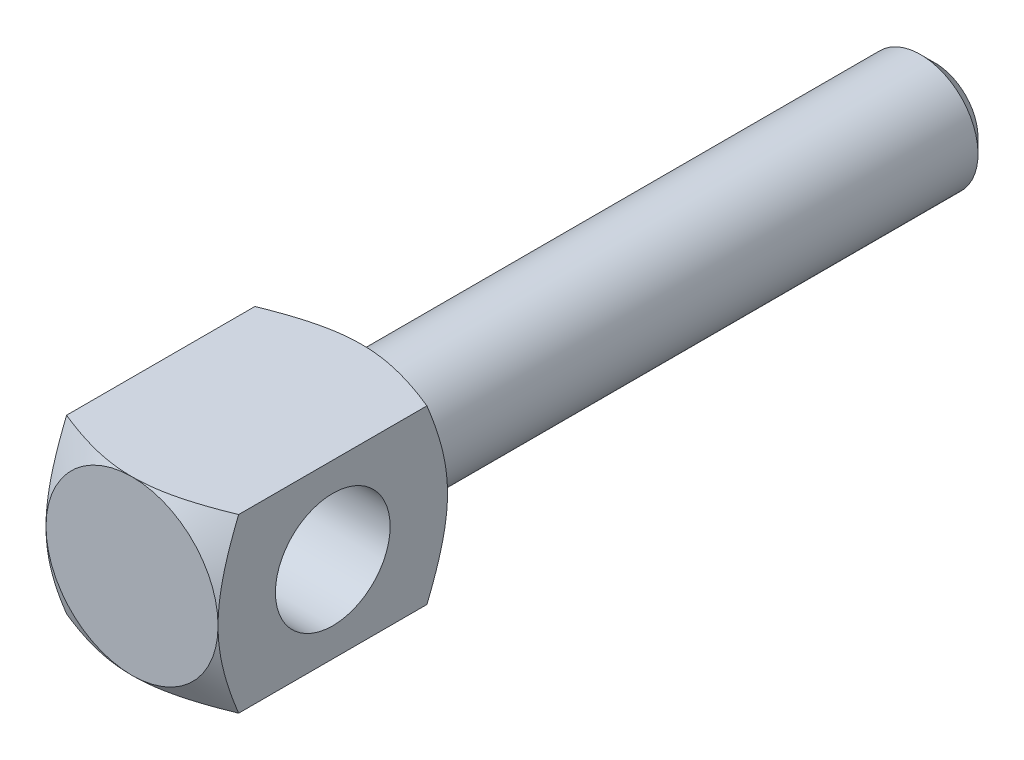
ISO-10303-21;
HEADER;
FILE_DESCRIPTION(('STEP AP214'),'2;1');
FILE_NAME('part.step','',(''),(''),'','','');
FILE_SCHEMA(('AUTOMOTIVE_DESIGN { 1 0 10303 214 1 1 1 1 }'));
ENDSEC;
DATA;
#1=APPLICATION_CONTEXT('core data for automotive mechanical design processes');
#2=APPLICATION_PROTOCOL_DEFINITION('international standard','automotive_design',2000,#1);
#3=PRODUCT_CONTEXT('',#1,'mechanical');
#4=PRODUCT('Part','Part','',(#3));
#5=PRODUCT_RELATED_PRODUCT_CATEGORY('part','',(#4));
#6=PRODUCT_DEFINITION_FORMATION('','',#4);
#7=PRODUCT_DEFINITION_CONTEXT('part definition',#1,'design');
#8=PRODUCT_DEFINITION('design','',#6,#7);
#9=PRODUCT_DEFINITION_SHAPE('','',#8);
#10=(LENGTH_UNIT() NAMED_UNIT(*) SI_UNIT(.MILLI.,.METRE.));
#11=(NAMED_UNIT(*) PLANE_ANGLE_UNIT() SI_UNIT($,.RADIAN.));
#12=(NAMED_UNIT(*) SI_UNIT($,.STERADIAN.) SOLID_ANGLE_UNIT());
#13=UNCERTAINTY_MEASURE_WITH_UNIT(LENGTH_MEASURE(1.E-05),#10,'distance_accuracy_value','');
#14=(GEOMETRIC_REPRESENTATION_CONTEXT(3) GLOBAL_UNCERTAINTY_ASSIGNED_CONTEXT((#13)) GLOBAL_UNIT_ASSIGNED_CONTEXT((#10,
#11,#12)) REPRESENTATION_CONTEXT('',''));
#15=CARTESIAN_POINT('',(0.,0.,0.));
#16=DIRECTION('',(0.,0.,1.));
#17=DIRECTION('',(1.,0.,0.));
#18=AXIS2_PLACEMENT_3D('',#15,#16,#17);
#19=CARTESIAN_POINT('',(0.,-8.,80.));
#20=DIRECTION('',(0.,0.,1.));
#21=DIRECTION('',(0.,-1.,0.));
#22=AXIS2_PLACEMENT_3D('',#19,#20,#21);
#23=PLANE('',#22);
#24=CARTESIAN_POINT('',(0.,0.,80.));
#25=DIRECTION('',(0.,0.,1.));
#26=DIRECTION('',(0.,-1.,0.));
#27=AXIS2_PLACEMENT_3D('',#24,#25,#26);
#28=CIRCLE('',#27,8.);
#29=CARTESIAN_POINT('',(0.,-8.,80.));
#30=VERTEX_POINT('',#29);
#31=EDGE_CURVE('E193',#30,#30,#28,.T.);
#32=ORIENTED_EDGE('',*,*,#31,.T.);
#33=EDGE_LOOP('',(#32));
#34=FACE_BOUND('',#33,.T.);
#35=CARTESIAN_POINT('',(0.,0.,80.));
#36=DIRECTION('',(0.,0.,1.));
#37=DIRECTION('',(0.,-1.,0.));
#38=AXIS2_PLACEMENT_3D('',#35,#36,#37);
#39=CIRCLE('',#38,12.);
#40=CARTESIAN_POINT('',(0.,-12.,80.));
#41=VERTEX_POINT('',#40);
#42=CARTESIAN_POINT('',(12.,0.,80.));
#43=VERTEX_POINT('',#42);
#44=EDGE_CURVE('E82',#41,#43,#39,.T.);
#45=ORIENTED_EDGE('',*,*,#44,.F.);
#46=CARTESIAN_POINT('',(0.,0.,80.));
#47=DIRECTION('',(0.,0.,1.));
#48=DIRECTION('',(0.,-1.,0.));
#49=AXIS2_PLACEMENT_3D('',#46,#47,#48);
#50=CIRCLE('',#49,12.);
#51=CARTESIAN_POINT('',(-12.,0.,80.));
#52=VERTEX_POINT('',#51);
#53=EDGE_CURVE('E18',#52,#41,#50,.T.);
#54=ORIENTED_EDGE('',*,*,#53,.F.);
#55=CARTESIAN_POINT('',(0.,12.,80.));
#56=VERTEX_POINT('',#55);
#57=EDGE_CURVE('E23',#56,#52,#50,.T.);
#58=ORIENTED_EDGE('',*,*,#57,.F.);
#59=EDGE_CURVE('E9',#43,#56,#50,.T.);
#60=ORIENTED_EDGE('',*,*,#59,.F.);
#61=EDGE_LOOP('',(#45,#54,#58,#60));
#62=FACE_BOUND('',#61,.T.);
#63=ADVANCED_FACE('F14',(#34,#62),#23,.F.);
#64=CARTESIAN_POINT('',(0.,0.,0.));
#65=DIRECTION('',(0.,0.,1.));
#66=DIRECTION('',(0.,-1.,0.));
#67=AXIS2_PLACEMENT_3D('',#64,#65,#66);
#68=PLANE('',#67);
#69=CARTESIAN_POINT('',(0.,0.,0.));
#70=DIRECTION('',(0.,0.,1.));
#71=DIRECTION('',(0.,-1.,0.));
#72=AXIS2_PLACEMENT_3D('',#69,#70,#71);
#73=CIRCLE('',#72,6.);
#74=CARTESIAN_POINT('',(0.,-6.,0.));
#75=VERTEX_POINT('',#74);
#76=EDGE_CURVE('E199',#75,#75,#73,.T.);
#77=ORIENTED_EDGE('',*,*,#76,.F.);
#78=EDGE_LOOP('',(#77));
#79=FACE_BOUND('',#78,.T.);
#80=ADVANCED_FACE('F16',(#79),#68,.F.);
#81=CARTESIAN_POINT('',(0.,0.,2.));
#82=DIRECTION('',(0.,0.,1.));
#83=DIRECTION('',(0.,-1.,0.));
#84=AXIS2_PLACEMENT_3D('',#81,#82,#83);
#85=CONICAL_SURFACE('',#84,8.,0.785398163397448);
#86=ORIENTED_EDGE('',*,*,#76,.T.);
#87=EDGE_LOOP('',(#86));
#88=FACE_BOUND('',#87,.T.);
#89=CARTESIAN_POINT('',(0.,0.,2.));
#90=DIRECTION('',(0.,0.,1.));
#91=DIRECTION('',(0.,-1.,0.));
#92=AXIS2_PLACEMENT_3D('',#89,#90,#91);
#93=CIRCLE('',#92,8.);
#94=CARTESIAN_POINT('',(0.,-8.,2.));
#95=VERTEX_POINT('',#94);
#96=EDGE_CURVE('E196',#95,#95,#93,.T.);
#97=ORIENTED_EDGE('',*,*,#96,.F.);
#98=EDGE_LOOP('',(#97));
#99=FACE_BOUND('',#98,.T.);
#100=ADVANCED_FACE('F251',(#88,#99),#85,.T.);
#101=CARTESIAN_POINT('',(0.,0.,140.));
#102=DIRECTION('',(0.,0.,1.));
#103=DIRECTION('',(0.,-1.,0.));
#104=AXIS2_PLACEMENT_3D('',#101,#102,#103);
#105=CYLINDRICAL_SURFACE('',#104,8.);
#106=ORIENTED_EDGE('',*,*,#31,.F.);
#107=EDGE_LOOP('',(#106));
#108=FACE_BOUND('',#107,.T.);
#109=ORIENTED_EDGE('',*,*,#96,.T.);
#110=EDGE_LOOP('',(#109));
#111=FACE_BOUND('',#110,.T.);
#112=ADVANCED_FACE('F254',(#108,#111),#105,.T.);
#113=CARTESIAN_POINT('',(0.,0.,86.0291163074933));
#114=DIRECTION('',(0.,0.,1.));
#115=DIRECTION('',(0.,-1.,0.));
#116=AXIS2_PLACEMENT_3D('',#113,#114,#115);
#117=CONICAL_SURFACE('',#116,22.4427357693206,1.0471975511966);
#118=CARTESIAN_POINT('',(-24.2982294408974,-12.,88.7179246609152));
#119=CARTESIAN_POINT('',(-23.7086454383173,-12.,88.4127647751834));
#120=CARTESIAN_POINT('',(-23.1182016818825,-12.,88.1092505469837));
#121=CARTESIAN_POINT('',(-21.9351490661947,-12.,87.5063885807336));
#122=CARTESIAN_POINT('',(-21.3425400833,-12.,87.2070410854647));
#123=CARTESIAN_POINT('',(-20.1534978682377,-12.,86.6127827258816));
#124=CARTESIAN_POINT('',(-19.5570591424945,-12.,86.3178828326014));
#125=CARTESIAN_POINT('',(-18.3610928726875,-12.,85.7344367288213));
#126=CARTESIAN_POINT('',(-17.7615653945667,-12.,85.4458903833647));
#127=CARTESIAN_POINT('',(-16.5244595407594,-12.,84.8605610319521));
#128=CARTESIAN_POINT('',(-15.8866592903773,-12.,84.5642453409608));
#129=CARTESIAN_POINT('',(-14.605771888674,-12.,83.9831303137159));
#130=CARTESIAN_POINT('',(-13.9626844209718,-12.,83.6983316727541));
#131=CARTESIAN_POINT('',(-12.6704771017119,-12.,83.1440967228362));
#132=CARTESIAN_POINT('',(-12.0213625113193,-12.,82.8746482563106));
#133=CARTESIAN_POINT('',(-11.0416965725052,-12.,82.4856727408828));
#134=CARTESIAN_POINT('',(-10.7141576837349,-12.,82.3585526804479));
#135=CARTESIAN_POINT('',(-10.0568574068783,-12.,82.1102063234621));
#136=CARTESIAN_POINT('',(-9.72709608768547,-12.,81.9889798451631));
#137=CARTESIAN_POINT('',(-9.06895687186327,-12.,81.7547235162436));
#138=CARTESIAN_POINT('',(-8.74060700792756,-12.,81.641615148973));
#139=CARTESIAN_POINT('',(-8.08133457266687,-12.,81.4231457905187));
#140=CARTESIAN_POINT('',(-7.75041201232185,-12.,81.3177847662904));
#141=CARTESIAN_POINT('',(-7.0857909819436,-12.,81.1160197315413));
#142=CARTESIAN_POINT('',(-6.75209224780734,-12.,81.0196165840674));
#143=CARTESIAN_POINT('',(-6.08190101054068,-12.,80.8371495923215));
#144=CARTESIAN_POINT('',(-5.74540850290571,-12.,80.7510857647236));
#145=CARTESIAN_POINT('',(-4.74513490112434,-12.,80.5138469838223));
#146=CARTESIAN_POINT('',(-4.07715641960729,-12.,80.3794466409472));
#147=CARTESIAN_POINT('',(-3.06859856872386,-12.,80.2204909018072));
#148=CARTESIAN_POINT('',(-2.73130381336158,-12.,80.1746123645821));
#149=CARTESIAN_POINT('',(-2.05498982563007,-12.,80.0982487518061));
#150=CARTESIAN_POINT('',(-1.71597079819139,-12.,80.0677618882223));
#151=CARTESIAN_POINT('',(-0.957299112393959,-12.,80.0178569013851));
#152=CARTESIAN_POINT('',(-0.537356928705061,-12.,80.0027032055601));
#153=CARTESIAN_POINT('',(0.302681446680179,-12.,79.9979591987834));
#154=CARTESIAN_POINT('',(0.722777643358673,-12.,80.0083698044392));
#155=CARTESIAN_POINT('',(1.5616630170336,-12.,80.0542594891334));
#156=CARTESIAN_POINT('',(1.98045192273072,-12.,80.0897434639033));
#157=CARTESIAN_POINT('',(2.81535093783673,-12.,80.184192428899));
#158=CARTESIAN_POINT('',(3.23146095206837,-12.,80.2431582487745));
#159=CARTESIAN_POINT('',(4.07191225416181,-12.,80.3842092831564));
#160=CARTESIAN_POINT('',(4.49614983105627,-12.,80.4669059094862));
#161=CARTESIAN_POINT('',(5.34033241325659,-12.,80.6517378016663));
#162=CARTESIAN_POINT('',(5.76027730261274,-12.,80.7538735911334));
#163=CARTESIAN_POINT('',(6.59600415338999,-12.,80.974730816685));
#164=CARTESIAN_POINT('',(7.01178366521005,-12.,81.0934614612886));
#165=CARTESIAN_POINT('',(7.63224330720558,-12.,81.2819580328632));
#166=CARTESIAN_POINT('',(7.83852562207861,-12.,81.3465227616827));
#167=CARTESIAN_POINT('',(8.25007065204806,-12.,81.4788265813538));
#168=CARTESIAN_POINT('',(8.45533336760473,-12.,81.5465656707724));
#169=CARTESIAN_POINT('',(9.02725013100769,-12.,81.7397944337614));
#170=CARTESIAN_POINT('',(9.39282355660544,-12.,81.8684872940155));
#171=CARTESIAN_POINT('',(10.1211104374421,-12.,82.1337513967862));
#172=CARTESIAN_POINT('',(10.4838237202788,-12.,82.270323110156));
#173=CARTESIAN_POINT('',(11.2067348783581,-12.,82.5501753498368));
#174=CARTESIAN_POINT('',(11.5669322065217,-12.,82.6934572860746));
#175=CARTESIAN_POINT('',(12.2850180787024,-12.,82.9857066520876));
#176=CARTESIAN_POINT('',(12.642906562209,-12.,83.1346742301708));
#177=CARTESIAN_POINT('',(13.3569451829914,-12.,83.4375943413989));
#178=CARTESIAN_POINT('',(13.7130934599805,-12.,83.5915512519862));
#179=CARTESIAN_POINT('',(14.4235611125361,-12.,83.9036334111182));
#180=CARTESIAN_POINT('',(14.7778804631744,-12.,84.0617587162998));
#181=CARTESIAN_POINT('',(15.838324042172,-12.,84.5414516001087));
#182=CARTESIAN_POINT('',(16.5420262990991,-12.,84.8683757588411));
#183=CARTESIAN_POINT('',(17.9465349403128,-12.,85.5339677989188));
#184=CARTESIAN_POINT('',(18.6473252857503,-12.,85.87266934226));
#185=CARTESIAN_POINT('',(20.0448594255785,-12.,86.5583429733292));
#186=CARTESIAN_POINT('',(20.7416031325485,-12.,86.9053152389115));
#187=CARTESIAN_POINT('',(22.1314681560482,-12.,87.6055143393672));
#188=CARTESIAN_POINT('',(22.82459120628,-12.,87.9587377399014));
#189=CARTESIAN_POINT('',(24.2082049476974,-12.,88.6702835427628));
#190=CARTESIAN_POINT('',(24.8986956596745,-12.,89.0286059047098));
#191=CARTESIAN_POINT('',(26.1844303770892,-12.,89.7006909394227));
#192=CARTESIAN_POINT('',(26.779944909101,-12.,90.0139366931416));
#193=CARTESIAN_POINT('',(27.9696112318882,-12.,90.643006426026));
#194=CARTESIAN_POINT('',(28.5637630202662,-12.,90.9588304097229));
#195=CARTESIAN_POINT('',(30.3446602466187,-12.,91.9096432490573));
#196=CARTESIAN_POINT('',(31.529671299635,-12.,92.5478805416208));
#197=CARTESIAN_POINT('',(33.8885309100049,-12.,93.8264689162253));
#198=CARTESIAN_POINT('',(35.0624017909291,-12.,94.4667788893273));
#199=CARTESIAN_POINT('',(36.8211677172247,-12.,95.4307219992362));
#200=CARTESIAN_POINT('',(37.40703228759,-12.,95.7525880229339));
#201=CARTESIAN_POINT('',(38.5781881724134,-12.,96.3973591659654));
#202=CARTESIAN_POINT('',(39.1634794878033,-12.,96.7202642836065));
#203=CARTESIAN_POINT('',(39.7485215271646,-12.,97.0436202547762));
#204=B_SPLINE_CURVE_WITH_KNOTS('',3,(#118,#119,#120,#121,#122,#123,#124,#125,#126,#127,#128,
#129,#130,#131,#132,#133,#134,#135,#136,#137,#138,#139,#140,#141,#142,#143,#144,#145,#146,#147,
#148,#149,#150,#151,#152,#153,#154,#155,#156,#157,#158,#159,#160,#161,#162,#163,#164,#165,#166,
#167,#168,#169,#170,#171,#172,#173,#174,#175,#176,#177,#178,#179,#180,#181,#182,#183,#184,#185,
#186,#187,#188,#189,#190,#191,#192,#193,#194,#195,#196,#197,#198,#199,#200,#201,#202,#203),
.UNSPECIFIED.,.F.,.F.,(4,2,2,2,2,2,2,2,2,2,2,2,2,2,2,2,2,2,2,2,2,2,2,2,2,2,2,2,2,2,2,2,2,2,2,2,
2,2,2,2,2,2,4),(0.,1.99163711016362,3.98338978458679,5.97944161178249,7.97545099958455,
10.0851776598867,12.1950314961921,14.3031903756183,15.3571713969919,16.4111198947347,
17.4528918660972,18.4946593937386,19.536527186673,20.5783966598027,22.6200951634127,
23.6410070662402,24.6618003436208,25.9216607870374,27.1815664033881,28.4417180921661,
29.7019143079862,30.9980518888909,32.2942243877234,33.5911190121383,34.2395496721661,
34.8879800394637,36.0505552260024,37.2131999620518,38.3760900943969,39.5390105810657,
40.7029805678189,41.8669663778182,44.1946361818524,46.5296172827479,48.8646486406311,
51.1984346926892,53.5322022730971,55.5508194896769,57.5694402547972,61.6072788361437,
65.6187152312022,67.6240859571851,69.6294534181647),.UNSPECIFIED.);
#205=CARTESIAN_POINT('',(-12.,-12.,82.8697557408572));
#206=VERTEX_POINT('',#205);
#207=EDGE_CURVE('E89',#41,#206,#204,.F.);
#208=ORIENTED_EDGE('',*,*,#207,.T.);
#209=CARTESIAN_POINT('',(-12.,24.2982294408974,88.7179246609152));
#210=CARTESIAN_POINT('',(-12.,23.7086454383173,88.4127647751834));
#211=CARTESIAN_POINT('',(-12.,23.1182016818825,88.1092505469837));
#212=CARTESIAN_POINT('',(-12.,21.9351490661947,87.5063885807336));
#213=CARTESIAN_POINT('',(-12.,21.3425400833,87.2070410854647));
#214=CARTESIAN_POINT('',(-12.,20.1534978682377,86.6127827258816));
#215=CARTESIAN_POINT('',(-12.,19.5570591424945,86.3178828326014));
#216=CARTESIAN_POINT('',(-12.,18.3610928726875,85.7344367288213));
#217=CARTESIAN_POINT('',(-12.,17.7615653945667,85.4458903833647));
#218=CARTESIAN_POINT('',(-12.,16.5244595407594,84.8605610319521));
#219=CARTESIAN_POINT('',(-12.,15.8866592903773,84.5642453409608));
#220=CARTESIAN_POINT('',(-12.,14.605771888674,83.9831303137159));
#221=CARTESIAN_POINT('',(-12.,13.9626844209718,83.6983316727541));
#222=CARTESIAN_POINT('',(-12.,12.6704771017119,83.1440967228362));
#223=CARTESIAN_POINT('',(-12.,12.0213625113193,82.8746482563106));
#224=CARTESIAN_POINT('',(-12.,11.0416965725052,82.4856727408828));
#225=CARTESIAN_POINT('',(-12.,10.7141576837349,82.3585526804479));
#226=CARTESIAN_POINT('',(-12.,10.0568574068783,82.1102063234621));
#227=CARTESIAN_POINT('',(-12.,9.72709608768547,81.9889798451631));
#228=CARTESIAN_POINT('',(-12.,9.06895687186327,81.7547235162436));
#229=CARTESIAN_POINT('',(-12.,8.74060700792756,81.641615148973));
#230=CARTESIAN_POINT('',(-12.,8.08133457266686,81.4231457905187));
#231=CARTESIAN_POINT('',(-12.,7.75041201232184,81.3177847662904));
#232=CARTESIAN_POINT('',(-12.,7.0857909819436,81.1160197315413));
#233=CARTESIAN_POINT('',(-12.,6.75209224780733,81.0196165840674));
#234=CARTESIAN_POINT('',(-12.,6.08190101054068,80.8371495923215));
#235=CARTESIAN_POINT('',(-12.,5.7454085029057,80.7510857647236));
#236=CARTESIAN_POINT('',(-12.,4.74513490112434,80.5138469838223));
#237=CARTESIAN_POINT('',(-12.,4.07715641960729,80.3794466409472));
#238=CARTESIAN_POINT('',(-12.,3.06859856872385,80.2204909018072));
#239=CARTESIAN_POINT('',(-12.,2.73130381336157,80.1746123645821));
#240=CARTESIAN_POINT('',(-12.,2.05498982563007,80.0982487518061));
#241=CARTESIAN_POINT('',(-12.,1.71597079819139,80.0677618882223));
#242=CARTESIAN_POINT('',(-12.,0.95729911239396,80.0178569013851));
#243=CARTESIAN_POINT('',(-12.,0.537356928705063,80.0027032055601));
#244=CARTESIAN_POINT('',(-12.,-0.302681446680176,79.9979591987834));
#245=CARTESIAN_POINT('',(-12.,-0.72277764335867,80.0083698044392));
#246=CARTESIAN_POINT('',(-12.,-1.56166301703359,80.0542594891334));
#247=CARTESIAN_POINT('',(-12.,-1.98045192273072,80.0897434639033));
#248=CARTESIAN_POINT('',(-12.,-2.81535093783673,80.184192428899));
#249=CARTESIAN_POINT('',(-12.,-3.23146095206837,80.2431582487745));
#250=CARTESIAN_POINT('',(-12.,-4.07191225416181,80.3842092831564));
#251=CARTESIAN_POINT('',(-12.,-4.49614983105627,80.4669059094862));
#252=CARTESIAN_POINT('',(-12.,-5.34033241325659,80.6517378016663));
#253=CARTESIAN_POINT('',(-12.,-5.76027730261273,80.7538735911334));
#254=CARTESIAN_POINT('',(-12.,-6.59600415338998,80.974730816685));
#255=CARTESIAN_POINT('',(-12.,-7.01178366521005,81.0934614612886));
#256=CARTESIAN_POINT('',(-12.,-7.63224330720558,81.2819580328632));
#257=CARTESIAN_POINT('',(-12.,-7.83852562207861,81.3465227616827));
#258=CARTESIAN_POINT('',(-12.,-8.25007065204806,81.4788265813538));
#259=CARTESIAN_POINT('',(-12.,-8.45533336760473,81.5465656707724));
#260=CARTESIAN_POINT('',(-12.,-9.02725013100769,81.7397944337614));
#261=CARTESIAN_POINT('',(-12.,-9.39282355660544,81.8684872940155));
#262=CARTESIAN_POINT('',(-12.,-10.1211104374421,82.1337513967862));
#263=CARTESIAN_POINT('',(-12.,-10.4838237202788,82.270323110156));
#264=CARTESIAN_POINT('',(-12.,-11.2067348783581,82.5501753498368));
#265=CARTESIAN_POINT('',(-12.,-11.5669322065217,82.6934572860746));
#266=CARTESIAN_POINT('',(-12.,-12.2850180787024,82.9857066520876));
#267=CARTESIAN_POINT('',(-12.,-12.642906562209,83.1346742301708));
#268=CARTESIAN_POINT('',(-12.,-13.3569451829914,83.4375943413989));
#269=CARTESIAN_POINT('',(-12.,-13.7130934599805,83.5915512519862));
#270=CARTESIAN_POINT('',(-12.,-14.4235611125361,83.9036334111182));
#271=CARTESIAN_POINT('',(-12.,-14.7778804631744,84.0617587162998));
#272=CARTESIAN_POINT('',(-12.,-15.838324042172,84.5414516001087));
#273=CARTESIAN_POINT('',(-12.,-16.5420262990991,84.8683757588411));
#274=CARTESIAN_POINT('',(-12.,-17.9465349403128,85.5339677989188));
#275=CARTESIAN_POINT('',(-12.,-18.6473252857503,85.87266934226));
#276=CARTESIAN_POINT('',(-12.,-20.0448594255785,86.5583429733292));
#277=CARTESIAN_POINT('',(-12.,-20.7416031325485,86.9053152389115));
#278=CARTESIAN_POINT('',(-12.,-22.1314681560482,87.6055143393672));
#279=CARTESIAN_POINT('',(-12.,-22.82459120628,87.9587377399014));
#280=CARTESIAN_POINT('',(-12.,-24.2082049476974,88.6702835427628));
#281=CARTESIAN_POINT('',(-12.,-24.8986956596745,89.0286059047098));
#282=CARTESIAN_POINT('',(-12.,-26.1844303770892,89.7006909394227));
#283=CARTESIAN_POINT('',(-12.,-26.779944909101,90.0139366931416));
#284=CARTESIAN_POINT('',(-12.,-27.9696112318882,90.643006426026));
#285=CARTESIAN_POINT('',(-12.,-28.5637630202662,90.9588304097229));
#286=CARTESIAN_POINT('',(-12.,-30.3446602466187,91.9096432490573));
#287=CARTESIAN_POINT('',(-12.,-31.529671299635,92.5478805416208));
#288=CARTESIAN_POINT('',(-12.,-33.8885309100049,93.8264689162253));
#289=CARTESIAN_POINT('',(-12.,-35.0624017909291,94.4667788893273));
#290=CARTESIAN_POINT('',(-12.,-36.8211677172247,95.4307219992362));
#291=CARTESIAN_POINT('',(-12.,-37.40703228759,95.7525880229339));
#292=CARTESIAN_POINT('',(-12.,-38.5781881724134,96.3973591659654));
#293=CARTESIAN_POINT('',(-12.,-39.1634794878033,96.7202642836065));
#294=CARTESIAN_POINT('',(-12.,-39.7485215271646,97.0436202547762));
#295=B_SPLINE_CURVE_WITH_KNOTS('',3,(#209,#210,#211,#212,#213,#214,#215,#216,#217,#218,#219,
#220,#221,#222,#223,#224,#225,#226,#227,#228,#229,#230,#231,#232,#233,#234,#235,#236,#237,#238,
#239,#240,#241,#242,#243,#244,#245,#246,#247,#248,#249,#250,#251,#252,#253,#254,#255,#256,#257,
#258,#259,#260,#261,#262,#263,#264,#265,#266,#267,#268,#269,#270,#271,#272,#273,#274,#275,#276,
#277,#278,#279,#280,#281,#282,#283,#284,#285,#286,#287,#288,#289,#290,#291,#292,#293,#294),
.UNSPECIFIED.,.F.,.F.,(4,2,2,2,2,2,2,2,2,2,2,2,2,2,2,2,2,2,2,2,2,2,2,2,2,2,2,2,2,2,2,2,2,2,2,2,
2,2,2,2,2,2,4),(0.,1.99163711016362,3.98338978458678,5.97944161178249,7.97545099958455,
10.0851776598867,12.1950314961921,14.3031903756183,15.3571713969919,16.4111198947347,
17.4528918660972,18.4946593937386,19.536527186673,20.5783966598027,22.6200951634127,
23.6410070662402,24.6618003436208,25.9216607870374,27.1815664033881,28.4417180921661,
29.7019143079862,30.9980518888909,32.2942243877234,33.5911190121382,34.2395496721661,
34.8879800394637,36.0505552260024,37.2131999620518,38.3760900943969,39.5390105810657,
40.7029805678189,41.8669663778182,44.1946361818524,46.5296172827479,48.8646486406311,
51.1984346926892,53.5322022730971,55.5508194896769,57.5694402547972,61.6072788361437,
65.6187152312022,67.6240859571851,69.6294534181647),.UNSPECIFIED.);
#296=EDGE_CURVE('E96',#52,#206,#295,.T.);
#297=ORIENTED_EDGE('',*,*,#296,.F.);
#298=ORIENTED_EDGE('',*,*,#53,.T.);
#299=EDGE_LOOP('',(#208,#297,#298));
#300=FACE_BOUND('',#299,.T.);
#301=ADVANCED_FACE('F94',(#300),#117,.T.);
#302=ORIENTED_EDGE('',*,*,#57,.T.);
#303=CARTESIAN_POINT('',(-12.,12.,82.8697557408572));
#304=VERTEX_POINT('',#303);
#305=EDGE_CURVE('E106',#304,#52,#295,.T.);
#306=ORIENTED_EDGE('',*,*,#305,.F.);
#307=CARTESIAN_POINT('',(-24.2982294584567,12.,88.7179246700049));
#308=CARTESIAN_POINT('',(-23.7086454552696,12.,88.4127647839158));
#309=CARTESIAN_POINT('',(-23.1182016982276,12.,88.1092505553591));
#310=CARTESIAN_POINT('',(-21.9351490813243,12.,87.5063885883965));
#311=CARTESIAN_POINT('',(-21.3425400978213,12.,87.2070410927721));
#312=CARTESIAN_POINT('',(-20.1534978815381,12.,86.612782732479));
#313=CARTESIAN_POINT('',(-19.5570591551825,12.,86.3178828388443));
#314=CARTESIAN_POINT('',(-18.361092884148,12.,85.7344367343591));
#315=CARTESIAN_POINT('',(-17.7615654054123,12.,85.445890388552));
#316=CARTESIAN_POINT('',(-16.5244595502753,12.,84.8605610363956));
#317=CARTESIAN_POINT('',(-15.8866592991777,12.,84.5642453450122));
#318=CARTESIAN_POINT('',(-14.6057718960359,12.,83.9831303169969));
#319=CARTESIAN_POINT('',(-13.9626844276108,12.,83.6983316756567));
#320=CARTESIAN_POINT('',(-12.6704771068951,12.,83.1440967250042));
#321=CARTESIAN_POINT('',(-12.0213625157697,12.,82.8746482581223));
#322=CARTESIAN_POINT('',(-11.0416965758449,12.,82.4856727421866));
#323=CARTESIAN_POINT('',(-10.7141576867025,12.,82.3585526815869));
#324=CARTESIAN_POINT('',(-10.056857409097,12.,82.1102063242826));
#325=CARTESIAN_POINT('',(-9.72709608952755,12.,81.9889798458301));
#326=CARTESIAN_POINT('',(-9.06895687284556,12.,81.7547235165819));
#327=CARTESIAN_POINT('',(-8.74060700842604,12.,81.6416151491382));
#328=CARTESIAN_POINT('',(-8.08133457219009,12.,81.4231457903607));
#329=CARTESIAN_POINT('',(-7.75041201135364,12.,81.3177847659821));
#330=CARTESIAN_POINT('',(-7.08579097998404,12.,81.1160197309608));
#331=CARTESIAN_POINT('',(-6.75209224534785,12.,81.019616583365));
#332=CARTESIAN_POINT('',(-6.08190100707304,12.,80.8371495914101));
#333=CARTESIAN_POINT('',(-5.74540849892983,12.,80.7510857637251));
#334=CARTESIAN_POINT('',(-4.74513489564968,12.,80.5138469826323));
#335=CARTESIAN_POINT('',(-4.07715641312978,12.,80.3794466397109));
#336=CARTESIAN_POINT('',(-3.06859856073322,12.,80.2204909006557));
#337=CARTESIAN_POINT('',(-2.73130380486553,12.,80.1746123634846));
#338=CARTESIAN_POINT('',(-2.05498981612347,12.,80.0982487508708));
#339=CARTESIAN_POINT('',(-1.71597078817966,12.,80.0677618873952));
#340=CARTESIAN_POINT('',(-0.957299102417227,12.,80.0178569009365));
#341=CARTESIAN_POINT('',(-0.537356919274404,12.,80.0027032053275));
#342=CARTESIAN_POINT('',(0.302681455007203,12.,79.9979591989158));
#343=CARTESIAN_POINT('',(0.722777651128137,12.,80.0083698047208));
#344=CARTESIAN_POINT('',(1.56166302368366,12.,80.0542594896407));
#345=CARTESIAN_POINT('',(1.98045192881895,12.,80.0897434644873));
#346=CARTESIAN_POINT('',(2.81535094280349,12.,80.1841924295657));
#347=CARTESIAN_POINT('',(3.23146095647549,12.,80.2431582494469));
#348=CARTESIAN_POINT('',(4.07191225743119,12.,80.3842092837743));
#349=CARTESIAN_POINT('',(4.49614983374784,12.,80.4669059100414));
#350=CARTESIAN_POINT('',(5.34033241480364,12.,80.6517378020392));
#351=CARTESIAN_POINT('',(5.76027730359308,12.,80.7538735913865));
#352=CARTESIAN_POINT('',(6.59600415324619,12.,80.9747308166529));
#353=CARTESIAN_POINT('',(7.01178366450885,12.,81.0934614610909));
#354=CARTESIAN_POINT('',(7.63224330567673,12.,81.2819580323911));
#355=CARTESIAN_POINT('',(7.83852562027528,12.,81.3465227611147));
#356=CARTESIAN_POINT('',(8.25007064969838,12.,81.4788265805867));
#357=CARTESIAN_POINT('',(8.45533336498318,12.,81.5465656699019));
#358=CARTESIAN_POINT('',(9.02725012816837,12.,81.7397944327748));
#359=CARTESIAN_POINT('',(9.39282355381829,12.,81.8684872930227));
#360=CARTESIAN_POINT('',(10.1211104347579,12.,82.1337513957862));
#361=CARTESIAN_POINT('',(10.4838237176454,12.,82.270323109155));
#362=CARTESIAN_POINT('',(11.2067348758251,12.,82.5501753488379));
#363=CARTESIAN_POINT('',(11.5669322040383,12.,82.6934572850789));
#364=CARTESIAN_POINT('',(12.285018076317,12.,82.9857066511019));
#365=CARTESIAN_POINT('',(12.6429065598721,12.,83.1346742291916));
#366=CARTESIAN_POINT('',(13.3569451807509,12.,83.4375943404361));
#367=CARTESIAN_POINT('',(13.7130934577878,12.,83.591551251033));
#368=CARTESIAN_POINT('',(14.4235611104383,12.,83.9036334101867));
#369=CARTESIAN_POINT('',(14.7778804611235,12.,84.0617587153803));
#370=CARTESIAN_POINT('',(15.8383240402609,12.,84.5414515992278));
#371=CARTESIAN_POINT('',(16.5420262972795,12.,84.8683757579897));
#372=CARTESIAN_POINT('',(17.9465349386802,12.,85.5339677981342));
#373=CARTESIAN_POINT('',(18.6473252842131,12.,85.8726693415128));
#374=CARTESIAN_POINT('',(20.0448594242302,12.,86.5583429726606));
#375=CARTESIAN_POINT('',(20.7416031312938,12.,86.905315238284));
#376=CARTESIAN_POINT('',(22.131468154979,12.,87.6055143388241));
#377=CARTESIAN_POINT('',(22.8245912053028,12.,87.9587377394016));
#378=CARTESIAN_POINT('',(24.2082049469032,12.,88.6702835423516));
#379=CARTESIAN_POINT('',(24.8986956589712,12.,89.0286059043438));
#380=CARTESIAN_POINT('',(26.1844303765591,12.,89.7006909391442));
#381=CARTESIAN_POINT('',(26.7799449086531,12.,90.0139366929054));
#382=CARTESIAN_POINT('',(27.9696112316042,12.,90.6430064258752));
#383=CARTESIAN_POINT('',(28.563763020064,12.,90.9588304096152));
#384=CARTESIAN_POINT('',(30.3446602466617,12.,91.9096432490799));
#385=CARTESIAN_POINT('',(31.5296712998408,12.,92.5478805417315));
#386=CARTESIAN_POINT('',(33.8885309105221,12.,93.8264689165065));
#387=CARTESIAN_POINT('',(35.0624017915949,12.,94.4667788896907));
#388=CARTESIAN_POINT('',(36.8211677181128,12.,95.4307219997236));
#389=CARTESIAN_POINT('',(37.4070322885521,12.,95.7525880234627));
#390=CARTESIAN_POINT('',(38.5781881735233,12.,96.3973591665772));
#391=CARTESIAN_POINT('',(39.163479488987,12.,96.7202642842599));
#392=CARTESIAN_POINT('',(39.7485215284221,12.,97.0436202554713));
#393=B_SPLINE_CURVE_WITH_KNOTS('',3,(#307,#308,#309,#310,#311,#312,#313,#314,#315,#316,#317,
#318,#319,#320,#321,#322,#323,#324,#325,#326,#327,#328,#329,#330,#331,#332,#333,#334,#335,#336,
#337,#338,#339,#340,#341,#342,#343,#344,#345,#346,#347,#348,#349,#350,#351,#352,#353,#354,#355,
#356,#357,#358,#359,#360,#361,#362,#363,#364,#365,#366,#367,#368,#369,#370,#371,#372,#373,#374,
#375,#376,#377,#378,#379,#380,#381,#382,#383,#384,#385,#386,#387,#388,#389,#390,#391,#392),
.UNSPECIFIED.,.F.,.F.,(4,2,2,2,2,2,2,2,2,2,2,2,2,2,2,2,2,2,2,2,2,2,2,2,2,2,2,2,2,2,2,2,2,2,2,2,
2,2,2,2,2,2,4),(0.,1.99163711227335,3.98338978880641,5.97944161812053,7.9754510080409,
10.0851776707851,12.1950315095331,14.303190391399,15.3571714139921,16.4111199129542,
17.4528918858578,18.4946594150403,19.5365272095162,20.5783966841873,22.6200951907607,
23.6410070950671,24.6618003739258,25.9216608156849,27.1815664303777,28.441718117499,
29.701914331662,30.9980519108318,32.2942244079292,33.5911190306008,34.239549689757,
34.887980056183,36.050555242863,37.2131999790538,38.3760901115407,39.5390105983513,
40.7029805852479,41.8669663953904,44.1946361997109,46.5296173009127,48.8646486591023,
51.1984347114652,53.5322022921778,55.5508195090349,57.5694402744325,61.6072788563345,
65.6187152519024,67.6240859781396,69.6294534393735),.UNSPECIFIED.);
#394=EDGE_CURVE('E37',#56,#304,#393,.F.);
#395=ORIENTED_EDGE('',*,*,#394,.F.);
#396=EDGE_LOOP('',(#302,#306,#395));
#397=FACE_BOUND('',#396,.T.);
#398=ADVANCED_FACE('F126',(#397),#117,.T.);
#399=CARTESIAN_POINT('',(12.,24.2982294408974,88.7179246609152));
#400=CARTESIAN_POINT('',(12.,23.7086454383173,88.4127647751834));
#401=CARTESIAN_POINT('',(12.,23.1182016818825,88.1092505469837));
#402=CARTESIAN_POINT('',(12.,21.9351490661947,87.5063885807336));
#403=CARTESIAN_POINT('',(12.,21.3425400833,87.2070410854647));
#404=CARTESIAN_POINT('',(12.,20.1534978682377,86.6127827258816));
#405=CARTESIAN_POINT('',(12.,19.5570591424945,86.3178828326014));
#406=CARTESIAN_POINT('',(12.,18.3610928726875,85.7344367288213));
#407=CARTESIAN_POINT('',(12.,17.7615653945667,85.4458903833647));
#408=CARTESIAN_POINT('',(12.,16.5244595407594,84.8605610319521));
#409=CARTESIAN_POINT('',(12.,15.8866592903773,84.5642453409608));
#410=CARTESIAN_POINT('',(12.,14.605771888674,83.9831303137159));
#411=CARTESIAN_POINT('',(12.,13.9626844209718,83.6983316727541));
#412=CARTESIAN_POINT('',(12.,12.6704771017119,83.1440967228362));
#413=CARTESIAN_POINT('',(12.,12.0213625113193,82.8746482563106));
#414=CARTESIAN_POINT('',(12.,11.0416965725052,82.4856727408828));
#415=CARTESIAN_POINT('',(12.,10.7141576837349,82.3585526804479));
#416=CARTESIAN_POINT('',(12.,10.0568574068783,82.1102063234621));
#417=CARTESIAN_POINT('',(12.,9.72709608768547,81.9889798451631));
#418=CARTESIAN_POINT('',(12.,9.06895687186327,81.7547235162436));
#419=CARTESIAN_POINT('',(12.,8.74060700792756,81.641615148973));
#420=CARTESIAN_POINT('',(12.,8.08133457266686,81.4231457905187));
#421=CARTESIAN_POINT('',(12.,7.75041201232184,81.3177847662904));
#422=CARTESIAN_POINT('',(12.,7.0857909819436,81.1160197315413));
#423=CARTESIAN_POINT('',(12.,6.75209224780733,81.0196165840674));
#424=CARTESIAN_POINT('',(12.,6.08190101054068,80.8371495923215));
#425=CARTESIAN_POINT('',(12.,5.7454085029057,80.7510857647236));
#426=CARTESIAN_POINT('',(12.,4.74513490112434,80.5138469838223));
#427=CARTESIAN_POINT('',(12.,4.07715641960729,80.3794466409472));
#428=CARTESIAN_POINT('',(12.,3.06859856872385,80.2204909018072));
#429=CARTESIAN_POINT('',(12.,2.73130381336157,80.1746123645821));
#430=CARTESIAN_POINT('',(12.,2.05498982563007,80.0982487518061));
#431=CARTESIAN_POINT('',(12.,1.71597079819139,80.0677618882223));
#432=CARTESIAN_POINT('',(12.,0.95729911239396,80.0178569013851));
#433=CARTESIAN_POINT('',(12.,0.537356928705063,80.0027032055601));
#434=CARTESIAN_POINT('',(12.,-0.302681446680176,79.9979591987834));
#435=CARTESIAN_POINT('',(12.,-0.72277764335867,80.0083698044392));
#436=CARTESIAN_POINT('',(12.,-1.56166301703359,80.0542594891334));
#437=CARTESIAN_POINT('',(12.,-1.98045192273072,80.0897434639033));
#438=CARTESIAN_POINT('',(12.,-2.81535093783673,80.184192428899));
#439=CARTESIAN_POINT('',(12.,-3.23146095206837,80.2431582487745));
#440=CARTESIAN_POINT('',(12.,-4.07191225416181,80.3842092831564));
#441=CARTESIAN_POINT('',(12.,-4.49614983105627,80.4669059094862));
#442=CARTESIAN_POINT('',(12.,-5.34033241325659,80.6517378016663));
#443=CARTESIAN_POINT('',(12.,-5.76027730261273,80.7538735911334));
#444=CARTESIAN_POINT('',(12.,-6.59600415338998,80.974730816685));
#445=CARTESIAN_POINT('',(12.,-7.01178366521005,81.0934614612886));
#446=CARTESIAN_POINT('',(12.,-7.63224330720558,81.2819580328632));
#447=CARTESIAN_POINT('',(12.,-7.83852562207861,81.3465227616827));
#448=CARTESIAN_POINT('',(12.,-8.25007065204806,81.4788265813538));
#449=CARTESIAN_POINT('',(12.,-8.45533336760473,81.5465656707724));
#450=CARTESIAN_POINT('',(12.,-9.02725013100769,81.7397944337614));
#451=CARTESIAN_POINT('',(12.,-9.39282355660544,81.8684872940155));
#452=CARTESIAN_POINT('',(12.,-10.1211104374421,82.1337513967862));
#453=CARTESIAN_POINT('',(12.,-10.4838237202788,82.270323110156));
#454=CARTESIAN_POINT('',(12.,-11.2067348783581,82.5501753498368));
#455=CARTESIAN_POINT('',(12.,-11.5669322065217,82.6934572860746));
#456=CARTESIAN_POINT('',(12.,-12.2850180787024,82.9857066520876));
#457=CARTESIAN_POINT('',(12.,-12.642906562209,83.1346742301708));
#458=CARTESIAN_POINT('',(12.,-13.3569451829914,83.4375943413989));
#459=CARTESIAN_POINT('',(12.,-13.7130934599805,83.5915512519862));
#460=CARTESIAN_POINT('',(12.,-14.4235611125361,83.9036334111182));
#461=CARTESIAN_POINT('',(12.,-14.7778804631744,84.0617587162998));
#462=CARTESIAN_POINT('',(12.,-15.838324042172,84.5414516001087));
#463=CARTESIAN_POINT('',(12.,-16.5420262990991,84.8683757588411));
#464=CARTESIAN_POINT('',(12.,-17.9465349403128,85.5339677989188));
#465=CARTESIAN_POINT('',(12.,-18.6473252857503,85.87266934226));
#466=CARTESIAN_POINT('',(12.,-20.0448594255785,86.5583429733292));
#467=CARTESIAN_POINT('',(12.,-20.7416031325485,86.9053152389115));
#468=CARTESIAN_POINT('',(12.,-22.1314681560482,87.6055143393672));
#469=CARTESIAN_POINT('',(12.,-22.82459120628,87.9587377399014));
#470=CARTESIAN_POINT('',(12.,-24.2082049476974,88.6702835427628));
#471=CARTESIAN_POINT('',(12.,-24.8986956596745,89.0286059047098));
#472=CARTESIAN_POINT('',(12.,-26.1844303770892,89.7006909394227));
#473=CARTESIAN_POINT('',(12.,-26.779944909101,90.0139366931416));
#474=CARTESIAN_POINT('',(12.,-27.9696112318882,90.643006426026));
#475=CARTESIAN_POINT('',(12.,-28.5637630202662,90.9588304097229));
#476=CARTESIAN_POINT('',(12.,-30.3446602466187,91.9096432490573));
#477=CARTESIAN_POINT('',(12.,-31.529671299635,92.5478805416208));
#478=CARTESIAN_POINT('',(12.,-33.8885309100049,93.8264689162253));
#479=CARTESIAN_POINT('',(12.,-35.0624017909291,94.4667788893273));
#480=CARTESIAN_POINT('',(12.,-36.8211677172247,95.4307219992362));
#481=CARTESIAN_POINT('',(12.,-37.40703228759,95.7525880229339));
#482=CARTESIAN_POINT('',(12.,-38.5781881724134,96.3973591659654));
#483=CARTESIAN_POINT('',(12.,-39.1634794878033,96.7202642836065));
#484=CARTESIAN_POINT('',(12.,-39.7485215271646,97.0436202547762));
#485=B_SPLINE_CURVE_WITH_KNOTS('',3,(#399,#400,#401,#402,#403,#404,#405,#406,#407,#408,#409,
#410,#411,#412,#413,#414,#415,#416,#417,#418,#419,#420,#421,#422,#423,#424,#425,#426,#427,#428,
#429,#430,#431,#432,#433,#434,#435,#436,#437,#438,#439,#440,#441,#442,#443,#444,#445,#446,#447,
#448,#449,#450,#451,#452,#453,#454,#455,#456,#457,#458,#459,#460,#461,#462,#463,#464,#465,#466,
#467,#468,#469,#470,#471,#472,#473,#474,#475,#476,#477,#478,#479,#480,#481,#482,#483,#484),
.UNSPECIFIED.,.F.,.F.,(4,2,2,2,2,2,2,2,2,2,2,2,2,2,2,2,2,2,2,2,2,2,2,2,2,2,2,2,2,2,2,2,2,2,2,2,
2,2,2,2,2,2,4),(0.,1.99163711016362,3.98338978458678,5.97944161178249,7.97545099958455,
10.0851776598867,12.1950314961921,14.3031903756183,15.3571713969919,16.4111198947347,
17.4528918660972,18.4946593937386,19.536527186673,20.5783966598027,22.6200951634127,
23.6410070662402,24.6618003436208,25.9216607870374,27.1815664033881,28.4417180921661,
29.7019143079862,30.9980518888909,32.2942243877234,33.5911190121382,34.2395496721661,
34.8879800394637,36.0505552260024,37.2131999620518,38.3760900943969,39.5390105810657,
40.7029805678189,41.8669663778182,44.1946361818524,46.5296172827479,48.8646486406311,
51.1984346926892,53.5322022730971,55.5508194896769,57.5694402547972,61.6072788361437,
65.6187152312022,67.6240859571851,69.6294534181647),.UNSPECIFIED.);
#486=CARTESIAN_POINT('',(12.,12.,82.8697557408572));
#487=VERTEX_POINT('',#486);
#488=EDGE_CURVE('E29',#487,#43,#485,.T.);
#489=ORIENTED_EDGE('',*,*,#488,.T.);
#490=ORIENTED_EDGE('',*,*,#59,.T.);
#491=EDGE_CURVE('E223',#487,#56,#393,.F.);
#492=ORIENTED_EDGE('',*,*,#491,.F.);
#493=EDGE_LOOP('',(#489,#490,#492));
#494=FACE_BOUND('',#493,.T.);
#495=ADVANCED_FACE('F290',(#494),#117,.T.);
#496=CARTESIAN_POINT('',(12.,-12.,82.8697557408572));
#497=VERTEX_POINT('',#496);
#498=EDGE_CURVE('E85',#43,#497,#485,.T.);
#499=ORIENTED_EDGE('',*,*,#498,.T.);
#500=EDGE_CURVE('E78',#497,#41,#204,.F.);
#501=ORIENTED_EDGE('',*,*,#500,.T.);
#502=ORIENTED_EDGE('',*,*,#44,.T.);
#503=EDGE_LOOP('',(#499,#501,#502));
#504=FACE_BOUND('',#503,.T.);
#505=ADVANCED_FACE('F80',(#504),#117,.T.);
#506=CARTESIAN_POINT('',(0.,-18.,112.));
#507=DIRECTION('',(0.,0.,-1.));
#508=DIRECTION('',(0.,1.,0.));
#509=AXIS2_PLACEMENT_3D('',#506,#507,#508);
#510=PLANE('',#509);
#511=CARTESIAN_POINT('',(0.,0.,112.));
#512=DIRECTION('',(0.,0.,-1.));
#513=DIRECTION('',(0.,1.,0.));
#514=AXIS2_PLACEMENT_3D('',#511,#512,#513);
#515=CIRCLE('',#514,12.);
#516=CARTESIAN_POINT('',(0.,12.,112.));
#517=VERTEX_POINT('',#516);
#518=CARTESIAN_POINT('',(12.,0.,112.));
#519=VERTEX_POINT('',#518);
#520=EDGE_CURVE('E100',#517,#519,#515,.T.);
#521=ORIENTED_EDGE('',*,*,#520,.F.);
#522=CARTESIAN_POINT('',(-12.,0.,112.));
#523=VERTEX_POINT('',#522);
#524=EDGE_CURVE('E201',#523,#517,#515,.T.);
#525=ORIENTED_EDGE('',*,*,#524,.F.);
#526=CARTESIAN_POINT('',(0.,-12.,112.));
#527=VERTEX_POINT('',#526);
#528=EDGE_CURVE('E203',#527,#523,#515,.T.);
#529=ORIENTED_EDGE('',*,*,#528,.F.);
#530=CARTESIAN_POINT('',(0.,0.,112.));
#531=DIRECTION('',(0.,0.,1.));
#532=DIRECTION('',(0.,-1.,0.));
#533=AXIS2_PLACEMENT_3D('',#530,#531,#532);
#534=CIRCLE('',#533,12.);
#535=EDGE_CURVE('E218',#527,#519,#534,.T.);
#536=ORIENTED_EDGE('',*,*,#535,.T.);
#537=EDGE_LOOP('',(#521,#525,#529,#536));
#538=FACE_BOUND('',#537,.T.);
#539=ADVANCED_FACE('F219',(#538),#510,.F.);
#540=CARTESIAN_POINT('',(0.,0.,112.));
#541=DIRECTION('',(0.,0.,-1.));
#542=DIRECTION('',(0.,1.,0.));
#543=AXIS2_PLACEMENT_3D('',#540,#541,#542);
#544=CONICAL_SURFACE('',#543,12.,1.0471975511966);
#545=CARTESIAN_POINT('',(12.,24.2869998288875,103.28788822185));
#546=CARTESIAN_POINT('',(12.,23.6975703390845,103.592940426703));
#547=CARTESIAN_POINT('',(12.,23.1072806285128,103.896345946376));
#548=CARTESIAN_POINT('',(12.,21.9245349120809,104.498987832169));
#549=CARTESIAN_POINT('',(12.,21.3320787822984,104.798223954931));
#550=CARTESIAN_POINT('',(12.,20.1433392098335,105.392257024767));
#551=CARTESIAN_POINT('',(12.,19.5470502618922,105.687042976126));
#552=CARTESIAN_POINT('',(12.,18.3513819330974,106.270256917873));
#553=CARTESIAN_POINT('',(12.,17.7520026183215,106.558685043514));
#554=CARTESIAN_POINT('',(12.,16.5152152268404,107.143758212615));
#555=CARTESIAN_POINT('',(12.,15.877585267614,107.439935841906));
#556=CARTESIAN_POINT('',(12.,14.597036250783,108.020767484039));
#557=CARTESIAN_POINT('',(12.,13.9541168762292,108.305420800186));
#558=CARTESIAN_POINT('',(12.,12.6622441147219,108.859355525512));
#559=CARTESIAN_POINT('',(12.,12.0132959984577,109.128649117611));
#560=CARTESIAN_POINT('',(12.,11.0338785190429,109.517383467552));
#561=CARTESIAN_POINT('',(12.,10.7064222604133,109.644421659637));
#562=CARTESIAN_POINT('',(12.,10.0492869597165,109.892601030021));
#563=CARTESIAN_POINT('',(12.,9.71960798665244,110.013742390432));
#564=CARTESIAN_POINT('',(12.,9.06162973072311,110.247826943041));
#565=CARTESIAN_POINT('',(12.,8.73335846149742,110.360848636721));
#566=CARTESIAN_POINT('',(12.,8.07424344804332,110.579140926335));
#567=CARTESIAN_POINT('',(12.,7.74339971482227,110.684411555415));
#568=CARTESIAN_POINT('',(12.,7.07893719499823,110.885992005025));
#569=CARTESIAN_POINT('',(12.,6.74531814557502,110.982300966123));
#570=CARTESIAN_POINT('',(12.,6.0752876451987,111.164576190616));
#571=CARTESIAN_POINT('',(12.,5.73887618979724,111.250542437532));
#572=CARTESIAN_POINT('',(12.,4.73883730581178,111.487490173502));
#573=CARTESIAN_POINT('',(12.,4.07101533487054,111.621692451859));
#574=CARTESIAN_POINT('',(12.,3.06270345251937,111.780351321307));
#575=CARTESIAN_POINT('',(12.,2.72549253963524,111.826130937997));
#576=CARTESIAN_POINT('',(12.,2.04935052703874,111.902299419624));
#577=CARTESIAN_POINT('',(12.,1.71041963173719,111.932690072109));
#578=CARTESIAN_POINT('',(12.,0.952123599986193,111.9823750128));
#579=CARTESIAN_POINT('',(12.,0.532470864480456,111.997416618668));
#580=CARTESIAN_POINT('',(12.,-0.306982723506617,112.00197182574));
#581=CARTESIAN_POINT('',(12.,-0.726783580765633,111.991484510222));
#582=CARTESIAN_POINT('',(12.,-1.56507615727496,111.945479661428));
#583=CARTESIAN_POINT('',(12.,-1.98356760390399,111.909957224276));
#584=CARTESIAN_POINT('',(12.,-2.81787294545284,111.815468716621));
#585=CARTESIAN_POINT('',(12.,-3.2336867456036,111.75650182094));
#586=CARTESIAN_POINT('',(12.,-4.07353262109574,111.615484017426));
#587=CARTESIAN_POINT('',(12.,-4.49746117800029,111.532823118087));
#588=CARTESIAN_POINT('',(12.,-5.34103169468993,111.348092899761));
#589=CARTESIAN_POINT('',(12.,-5.76067353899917,111.24602305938));
#590=CARTESIAN_POINT('',(12.,-6.59579927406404,111.025321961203));
#591=CARTESIAN_POINT('',(12.,-7.01128073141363,110.906681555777));
#592=CARTESIAN_POINT('',(12.,-7.63129780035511,110.718334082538));
#593=CARTESIAN_POINT('',(12.,-7.8374333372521,110.653821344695));
#594=CARTESIAN_POINT('',(12.,-8.24868619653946,110.521625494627));
#595=CARTESIAN_POINT('',(12.,-8.45380351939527,110.453942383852));
#596=CARTESIAN_POINT('',(12.,-9.02559999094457,110.260778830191));
#597=CARTESIAN_POINT('',(12.,-9.39119751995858,110.132091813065));
#598=CARTESIAN_POINT('',(12.,-10.1195318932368,109.866836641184));
#599=CARTESIAN_POINT('',(12.,-10.4822685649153,109.730268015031));
#600=CARTESIAN_POINT('',(12.,-11.20522588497,109.450419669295));
#601=CARTESIAN_POINT('',(12.,-11.5654459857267,109.307138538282));
#602=CARTESIAN_POINT('',(12.,-12.2835767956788,109.014888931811));
#603=CARTESIAN_POINT('',(12.,-12.6414874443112,108.865920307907));
#604=CARTESIAN_POINT('',(12.,-13.3555701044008,108.562996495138));
#605=CARTESIAN_POINT('',(12.,-13.7117402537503,108.409036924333));
#606=CARTESIAN_POINT('',(12.,-14.4222511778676,108.096948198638));
#607=CARTESIAN_POINT('',(12.,-14.7765919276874,107.938818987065));
#608=CARTESIAN_POINT('',(12.,-15.8370990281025,107.459112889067));
#609=CARTESIAN_POINT('',(12.,-16.5408427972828,107.132177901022));
#610=CARTESIAN_POINT('',(12.,-17.945436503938,106.466559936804));
#611=CARTESIAN_POINT('',(12.,-18.6462703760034,106.127843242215));
#612=CARTESIAN_POINT('',(12.,-20.0438906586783,105.442137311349));
#613=CARTESIAN_POINT('',(12.,-20.7406769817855,105.09514789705));
#614=CARTESIAN_POINT('',(12.,-22.1306262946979,104.394913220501));
#615=CARTESIAN_POINT('',(12.,-22.8237910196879,104.041671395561));
#616=CARTESIAN_POINT('',(12.,-24.2074876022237,103.33008773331));
#617=CARTESIAN_POINT('',(12.,-24.8980194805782,102.971745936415));
#618=CARTESIAN_POINT('',(12.,-26.1838361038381,102.299621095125));
#619=CARTESIAN_POINT('',(12.,-26.7793914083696,101.986355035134));
#620=CARTESIAN_POINT('',(12.,-27.9691390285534,101.3572442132));
#621=CARTESIAN_POINT('',(12.,-28.5633313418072,101.041399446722));
#622=CARTESIAN_POINT('',(12.,-30.3443499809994,100.090523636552));
#623=CARTESIAN_POINT('',(12.,-31.5294416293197,99.4522436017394));
#624=CARTESIAN_POINT('',(12.,-33.8884545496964,98.1735728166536));
#625=CARTESIAN_POINT('',(12.,-35.0623981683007,97.5332232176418));
#626=CARTESIAN_POINT('',(12.,-36.8212729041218,96.5692202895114));
#627=CARTESIAN_POINT('',(12.,-37.407173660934,96.2473342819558));
#628=CARTESIAN_POINT('',(12.,-38.5784018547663,95.6025230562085));
#629=CARTESIAN_POINT('',(12.,-39.1637292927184,95.2795978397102));
#630=CARTESIAN_POINT('',(12.,-39.7488074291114,94.9562217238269));
#631=B_SPLINE_CURVE_WITH_KNOTS('',3,(#545,#546,#547,#548,#549,#550,#551,#552,#553,#554,#555,
#556,#557,#558,#559,#560,#561,#562,#563,#564,#565,#566,#567,#568,#569,#570,#571,#572,#573,#574,
#575,#576,#577,#578,#579,#580,#581,#582,#583,#584,#585,#586,#587,#588,#589,#590,#591,#592,#593,
#594,#595,#596,#597,#598,#599,#600,#601,#602,#603,#604,#605,#606,#607,#608,#609,#610,#611,#612,
#613,#614,#615,#616,#617,#618,#619,#620,#621,#622,#623,#624,#625,#626,#627,#628,#629,#630),
.UNSPECIFIED.,.F.,.F.,(4,2,2,2,2,2,2,2,2,2,2,2,2,2,2,2,2,2,2,2,2,2,2,2,2,2,2,2,2,2,2,2,2,2,2,2,
2,2,2,2,2,2,4),(0.,1.99107696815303,3.98226966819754,5.97776715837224,7.97322215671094,
10.0823108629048,12.1915268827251,14.299045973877,15.3527069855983,16.4063354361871,
17.4477997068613,18.489259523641,19.5308191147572,20.5723803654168,22.613500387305,
23.634123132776,24.6546272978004,25.9136093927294,27.1726366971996,28.4319106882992,
29.6912290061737,30.9864374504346,32.2816806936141,33.5776418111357,34.2256056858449,
34.8735692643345,36.0362067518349,37.1989138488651,38.3618665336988,39.5248495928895,
40.688882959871,41.8529321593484,44.1807285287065,46.5158469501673,48.851015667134,
51.1849382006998,53.5188422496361,55.53759607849,57.5563534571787,61.5944657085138,
65.6061505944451,67.6116453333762,69.6171368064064),.UNSPECIFIED.);
#632=CARTESIAN_POINT('',(12.,12.,109.130244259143));
#633=VERTEX_POINT('',#632);
#634=EDGE_CURVE('E179',#519,#633,#631,.F.);
#635=ORIENTED_EDGE('',*,*,#634,.T.);
#636=CARTESIAN_POINT('',(-24.2869998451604,12.,103.287888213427));
#637=CARTESIAN_POINT('',(-23.697570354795,12.,103.592940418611));
#638=CARTESIAN_POINT('',(-23.1072806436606,12.,103.896345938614));
#639=CARTESIAN_POINT('',(-21.9245349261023,12.,104.498987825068));
#640=CARTESIAN_POINT('',(-21.3320787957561,12.,104.79822394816));
#641=CARTESIAN_POINT('',(-20.1433392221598,12.,105.392257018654));
#642=CARTESIAN_POINT('',(-19.5470502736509,12.,105.687042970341));
#643=CARTESIAN_POINT('',(-18.3513819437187,12.,106.270256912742));
#644=CARTESIAN_POINT('',(-17.752002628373,12.,106.558685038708));
#645=CARTESIAN_POINT('',(-16.5152152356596,12.,107.143758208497));
#646=CARTESIAN_POINT('',(-15.8775852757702,12.,107.439935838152));
#647=CARTESIAN_POINT('',(-14.5970362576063,12.,108.020767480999));
#648=CARTESIAN_POINT('',(-13.9541168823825,12.,108.305420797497));
#649=CARTESIAN_POINT('',(-12.6622441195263,12.,108.859355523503));
#650=CARTESIAN_POINT('',(-12.013296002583,12.,109.128649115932));
#651=CARTESIAN_POINT('',(-11.0338785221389,12.,109.517383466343));
#652=CARTESIAN_POINT('',(-10.7064222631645,12.,109.644421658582));
#653=CARTESIAN_POINT('',(-10.0492869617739,12.,109.89260102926));
#654=CARTESIAN_POINT('',(-9.71960798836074,12.,110.013742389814));
#655=CARTESIAN_POINT('',(-9.06162973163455,12.,110.247826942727));
#656=CARTESIAN_POINT('',(-8.73335846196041,12.,110.360848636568));
#657=CARTESIAN_POINT('',(-8.07424344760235,12.,110.579140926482));
#658=CARTESIAN_POINT('',(-7.7433997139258,12.,110.6844115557));
#659=CARTESIAN_POINT('',(-7.07893719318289,12.,110.885992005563));
#660=CARTESIAN_POINT('',(-6.7453181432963,12.,110.982300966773));
#661=CARTESIAN_POINT('',(-6.07528764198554,12.,111.16457619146));
#662=CARTESIAN_POINT('',(-5.738876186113,12.,111.250542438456));
#663=CARTESIAN_POINT('',(-4.73883730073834,12.,111.487490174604));
#664=CARTESIAN_POINT('',(-4.07101532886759,12.,111.621692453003));
#665=CARTESIAN_POINT('',(-3.06270344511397,12.,111.780351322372));
#666=CARTESIAN_POINT('',(-2.72549253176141,12.,111.826130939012));
#667=CARTESIAN_POINT('',(-2.0493505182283,12.,111.902299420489));
#668=CARTESIAN_POINT('',(-1.71041962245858,12.,111.932690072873));
#669=CARTESIAN_POINT('',(-0.952123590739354,12.,111.982375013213));
#670=CARTESIAN_POINT('',(-0.532470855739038,12.,111.997416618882));
#671=CARTESIAN_POINT('',(0.306982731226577,12.,112.001971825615));
#672=CARTESIAN_POINT('',(0.726783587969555,12.,111.99148450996));
#673=CARTESIAN_POINT('',(1.56507616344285,12.,111.945479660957));
#674=CARTESIAN_POINT('',(1.98356760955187,12.,111.909957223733));
#675=CARTESIAN_POINT('',(2.81787295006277,12.,111.815468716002));
#676=CARTESIAN_POINT('',(3.23368674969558,12.,111.756501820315));
#677=CARTESIAN_POINT('',(4.07353262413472,12.,111.615484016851));
#678=CARTESIAN_POINT('',(4.49746118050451,12.,111.53282311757));
#679=CARTESIAN_POINT('',(5.34103169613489,12.,111.348092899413));
#680=CARTESIAN_POINT('',(5.76067353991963,12.,111.246023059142));
#681=CARTESIAN_POINT('',(6.59579927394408,12.,111.025321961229));
#682=CARTESIAN_POINT('',(7.01128073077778,12.,110.906681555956));
#683=CARTESIAN_POINT('',(7.63129779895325,12.,110.718334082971));
#684=CARTESIAN_POINT('',(7.83743333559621,12.,110.653821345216));
#685=CARTESIAN_POINT('',(8.24868619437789,12.,110.521625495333));
#686=CARTESIAN_POINT('',(8.45380351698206,12.,110.453942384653));
#687=CARTESIAN_POINT('',(9.02559998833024,12.,110.260778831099));
#688=CARTESIAN_POINT('',(9.39119751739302,12.,110.132091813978));
#689=CARTESIAN_POINT('',(10.1195318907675,12.,109.866836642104));
#690=CARTESIAN_POINT('',(10.4822685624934,12.,109.730268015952));
#691=CARTESIAN_POINT('',(11.2052258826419,12.,109.450419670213));
#692=CARTESIAN_POINT('',(11.5654459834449,12.,109.307138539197));
#693=CARTESIAN_POINT('',(12.2835767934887,12.,109.014888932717));
#694=CARTESIAN_POINT('',(12.6414874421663,12.,108.865920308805));
#695=CARTESIAN_POINT('',(13.355570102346,12.,108.562996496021));
#696=CARTESIAN_POINT('',(13.7117402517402,12.,108.409036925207));
#697=CARTESIAN_POINT('',(14.4222511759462,12.,108.096948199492));
#698=CARTESIAN_POINT('',(14.77659192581,12.,107.938818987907));
#699=CARTESIAN_POINT('',(15.8370990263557,12.,107.459112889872));
#700=CARTESIAN_POINT('',(16.5408427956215,12.,107.1321779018));
#701=CARTESIAN_POINT('',(17.9454365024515,12.,106.466559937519));
#702=CARTESIAN_POINT('',(18.6462703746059,12.,106.127843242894));
#703=CARTESIAN_POINT('',(20.0438906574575,12.,105.442137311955));
#704=CARTESIAN_POINT('',(20.7406769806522,12.,105.095147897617));
#705=CARTESIAN_POINT('',(22.1306262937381,12.,104.394913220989));
#706=CARTESIAN_POINT('',(22.823791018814,12.,104.041671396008));
#707=CARTESIAN_POINT('',(24.2074876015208,12.,103.330087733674));
#708=CARTESIAN_POINT('',(24.8980194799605,12.,102.971745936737));
#709=CARTESIAN_POINT('',(26.1838361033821,12.,102.299621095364));
#710=CARTESIAN_POINT('',(26.7793914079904,12.,101.986355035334));
#711=CARTESIAN_POINT('',(27.9691390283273,12.,101.35724421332));
#712=CARTESIAN_POINT('',(28.5633313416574,12.,101.041399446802));
#713=CARTESIAN_POINT('',(30.3443499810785,12.,100.09052363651));
#714=CARTESIAN_POINT('',(31.5294416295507,12.,99.4522436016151));
#715=CARTESIAN_POINT('',(33.8884545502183,12.,98.1735728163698));
#716=CARTESIAN_POINT('',(35.0623981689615,12.,97.5332232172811));
#717=CARTESIAN_POINT('',(36.8212729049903,12.,96.5692202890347));
#718=CARTESIAN_POINT('',(37.4071736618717,12.,96.2473342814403));
#719=CARTESIAN_POINT('',(38.5784018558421,12.,95.6025230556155));
#720=CARTESIAN_POINT('',(39.1637292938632,12.,95.2795978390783));
#721=CARTESIAN_POINT('',(39.7488074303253,12.,94.956221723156));
#722=B_SPLINE_CURVE_WITH_KNOTS('',3,(#636,#637,#638,#639,#640,#641,#642,#643,#644,#645,#646,
#647,#648,#649,#650,#651,#652,#653,#654,#655,#656,#657,#658,#659,#660,#661,#662,#663,#664,#665,
#666,#667,#668,#669,#670,#671,#672,#673,#674,#675,#676,#677,#678,#679,#680,#681,#682,#683,#684,
#685,#686,#687,#688,#689,#690,#691,#692,#693,#694,#695,#696,#697,#698,#699,#700,#701,#702,#703,
#704,#705,#706,#707,#708,#709,#710,#711,#712,#713,#714,#715,#716,#717,#718,#719,#720,#721),
.UNSPECIFIED.,.F.,.F.,(4,2,2,2,2,2,2,2,2,2,2,2,2,2,2,2,2,2,2,2,2,2,2,2,2,2,2,2,2,2,2,2,2,2,2,2,
2,2,2,2,2,2,4),(0.,1.99107697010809,3.98226967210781,5.97776716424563,7.97322216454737,
10.0823108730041,12.1915268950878,14.2990459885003,15.3527070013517,16.4063354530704,
17.447799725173,18.4892595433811,19.5308191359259,20.5723803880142,22.6135004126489,
23.6341231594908,24.6546273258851,25.9136094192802,27.1726367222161,28.4319107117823,
29.6912290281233,30.9864374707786,32.2816807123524,33.5776418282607,34.2256057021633,
34.8735692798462,36.036206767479,37.1989138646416,38.361866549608,39.5248496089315,
40.6888829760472,41.8529321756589,44.1807285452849,46.5158469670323,48.8510156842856,
51.1849382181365,53.5188422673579,55.5375960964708,57.5563534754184,61.5944657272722,
65.6061506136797,67.6116453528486,69.6171368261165),.UNSPECIFIED.);
#723=EDGE_CURVE('E178',#517,#633,#722,.T.);
#724=ORIENTED_EDGE('',*,*,#723,.F.);
#725=ORIENTED_EDGE('',*,*,#520,.T.);
#726=EDGE_LOOP('',(#635,#724,#725));
#727=FACE_BOUND('',#726,.T.);
#728=ADVANCED_FACE('F167',(#727),#544,.T.);
#729=CARTESIAN_POINT('',(12.,-12.,109.130244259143));
#730=VERTEX_POINT('',#729);
#731=EDGE_CURVE('E172',#730,#519,#631,.F.);
#732=ORIENTED_EDGE('',*,*,#731,.T.);
#733=ORIENTED_EDGE('',*,*,#535,.F.);
#734=CARTESIAN_POINT('',(-24.2869998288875,-12.,103.28788822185));
#735=CARTESIAN_POINT('',(-23.6975703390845,-12.,103.592940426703));
#736=CARTESIAN_POINT('',(-23.1072806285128,-12.,103.896345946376));
#737=CARTESIAN_POINT('',(-21.9245349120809,-12.,104.498987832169));
#738=CARTESIAN_POINT('',(-21.3320787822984,-12.,104.798223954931));
#739=CARTESIAN_POINT('',(-20.1433392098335,-12.,105.392257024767));
#740=CARTESIAN_POINT('',(-19.5470502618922,-12.,105.687042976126));
#741=CARTESIAN_POINT('',(-18.3513819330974,-12.,106.270256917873));
#742=CARTESIAN_POINT('',(-17.7520026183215,-12.,106.558685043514));
#743=CARTESIAN_POINT('',(-16.5152152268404,-12.,107.143758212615));
#744=CARTESIAN_POINT('',(-15.877585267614,-12.,107.439935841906));
#745=CARTESIAN_POINT('',(-14.597036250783,-12.,108.020767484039));
#746=CARTESIAN_POINT('',(-13.9541168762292,-12.,108.305420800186));
#747=CARTESIAN_POINT('',(-12.6622441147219,-12.,108.859355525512));
#748=CARTESIAN_POINT('',(-12.0132959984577,-12.,109.128649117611));
#749=CARTESIAN_POINT('',(-11.0338785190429,-12.,109.517383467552));
#750=CARTESIAN_POINT('',(-10.7064222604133,-12.,109.644421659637));
#751=CARTESIAN_POINT('',(-10.0492869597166,-12.,109.892601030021));
#752=CARTESIAN_POINT('',(-9.71960798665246,-12.,110.013742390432));
#753=CARTESIAN_POINT('',(-9.06162973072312,-12.,110.247826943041));
#754=CARTESIAN_POINT('',(-8.73335846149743,-12.,110.360848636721));
#755=CARTESIAN_POINT('',(-8.07424344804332,-12.,110.579140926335));
#756=CARTESIAN_POINT('',(-7.74339971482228,-12.,110.684411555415));
#757=CARTESIAN_POINT('',(-7.07893719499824,-12.,110.885992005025));
#758=CARTESIAN_POINT('',(-6.74531814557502,-12.,110.982300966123));
#759=CARTESIAN_POINT('',(-6.0752876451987,-12.,111.164576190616));
#760=CARTESIAN_POINT('',(-5.73887618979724,-12.,111.250542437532));
#761=CARTESIAN_POINT('',(-4.73883730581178,-12.,111.487490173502));
#762=CARTESIAN_POINT('',(-4.07101533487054,-12.,111.621692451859));
#763=CARTESIAN_POINT('',(-3.06270345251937,-12.,111.780351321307));
#764=CARTESIAN_POINT('',(-2.72549253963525,-12.,111.826130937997));
#765=CARTESIAN_POINT('',(-2.04935052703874,-12.,111.902299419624));
#766=CARTESIAN_POINT('',(-1.7104196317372,-12.,111.932690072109));
#767=CARTESIAN_POINT('',(-0.952123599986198,-12.,111.9823750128));
#768=CARTESIAN_POINT('',(-0.532470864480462,-12.,111.997416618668));
#769=CARTESIAN_POINT('',(0.30698272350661,-12.,112.00197182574));
#770=CARTESIAN_POINT('',(0.726783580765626,-12.,111.991484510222));
#771=CARTESIAN_POINT('',(1.56507615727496,-12.,111.945479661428));
#772=CARTESIAN_POINT('',(1.98356760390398,-12.,111.909957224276));
#773=CARTESIAN_POINT('',(2.81787294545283,-12.,111.815468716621));
#774=CARTESIAN_POINT('',(3.23368674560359,-12.,111.75650182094));
#775=CARTESIAN_POINT('',(4.07353262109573,-12.,111.615484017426));
#776=CARTESIAN_POINT('',(4.49746117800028,-12.,111.532823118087));
#777=CARTESIAN_POINT('',(5.34103169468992,-12.,111.348092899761));
#778=CARTESIAN_POINT('',(5.76067353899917,-12.,111.24602305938));
#779=CARTESIAN_POINT('',(6.59579927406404,-12.,111.025321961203));
#780=CARTESIAN_POINT('',(7.01128073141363,-12.,110.906681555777));
#781=CARTESIAN_POINT('',(7.63129780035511,-12.,110.718334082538));
#782=CARTESIAN_POINT('',(7.8374333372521,-12.,110.653821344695));
#783=CARTESIAN_POINT('',(8.24868619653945,-12.,110.521625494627));
#784=CARTESIAN_POINT('',(8.45380351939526,-12.,110.453942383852));
#785=CARTESIAN_POINT('',(9.02559999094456,-12.,110.260778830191));
#786=CARTESIAN_POINT('',(9.39119751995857,-12.,110.132091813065));
#787=CARTESIAN_POINT('',(10.1195318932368,-12.,109.866836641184));
#788=CARTESIAN_POINT('',(10.4822685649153,-12.,109.730268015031));
#789=CARTESIAN_POINT('',(11.20522588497,-12.,109.450419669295));
#790=CARTESIAN_POINT('',(11.5654459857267,-12.,109.307138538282));
#791=CARTESIAN_POINT('',(12.2835767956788,-12.,109.014888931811));
#792=CARTESIAN_POINT('',(12.6414874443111,-12.,108.865920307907));
#793=CARTESIAN_POINT('',(13.3555701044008,-12.,108.562996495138));
#794=CARTESIAN_POINT('',(13.7117402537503,-12.,108.409036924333));
#795=CARTESIAN_POINT('',(14.4222511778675,-12.,108.096948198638));
#796=CARTESIAN_POINT('',(14.7765919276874,-12.,107.938818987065));
#797=CARTESIAN_POINT('',(15.8370990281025,-12.,107.459112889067));
#798=CARTESIAN_POINT('',(16.5408427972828,-12.,107.132177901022));
#799=CARTESIAN_POINT('',(17.945436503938,-12.,106.466559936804));
#800=CARTESIAN_POINT('',(18.6462703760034,-12.,106.127843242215));
#801=CARTESIAN_POINT('',(20.0438906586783,-12.,105.442137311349));
#802=CARTESIAN_POINT('',(20.7406769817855,-12.,105.09514789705));
#803=CARTESIAN_POINT('',(22.1306262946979,-12.,104.394913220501));
#804=CARTESIAN_POINT('',(22.8237910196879,-12.,104.041671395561));
#805=CARTESIAN_POINT('',(24.2074876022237,-12.,103.33008773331));
#806=CARTESIAN_POINT('',(24.8980194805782,-12.,102.971745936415));
#807=CARTESIAN_POINT('',(26.1838361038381,-12.,102.299621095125));
#808=CARTESIAN_POINT('',(26.7793914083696,-12.,101.986355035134));
#809=CARTESIAN_POINT('',(27.9691390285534,-12.,101.3572442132));
#810=CARTESIAN_POINT('',(28.5633313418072,-12.,101.041399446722));
#811=CARTESIAN_POINT('',(30.3443499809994,-12.,100.090523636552));
#812=CARTESIAN_POINT('',(31.5294416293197,-12.,99.4522436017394));
#813=CARTESIAN_POINT('',(33.8884545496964,-12.,98.1735728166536));
#814=CARTESIAN_POINT('',(35.0623981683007,-12.,97.5332232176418));
#815=CARTESIAN_POINT('',(36.8212729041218,-12.,96.5692202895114));
#816=CARTESIAN_POINT('',(37.4071736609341,-12.,96.2473342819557));
#817=CARTESIAN_POINT('',(38.5784018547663,-12.,95.6025230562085));
#818=CARTESIAN_POINT('',(39.1637292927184,-12.,95.2795978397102));
#819=CARTESIAN_POINT('',(39.7488074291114,-12.,94.9562217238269));
#820=B_SPLINE_CURVE_WITH_KNOTS('',3,(#734,#735,#736,#737,#738,#739,#740,#741,#742,#743,#744,
#745,#746,#747,#748,#749,#750,#751,#752,#753,#754,#755,#756,#757,#758,#759,#760,#761,#762,#763,
#764,#765,#766,#767,#768,#769,#770,#771,#772,#773,#774,#775,#776,#777,#778,#779,#780,#781,#782,
#783,#784,#785,#786,#787,#788,#789,#790,#791,#792,#793,#794,#795,#796,#797,#798,#799,#800,#801,
#802,#803,#804,#805,#806,#807,#808,#809,#810,#811,#812,#813,#814,#815,#816,#817,#818,#819),
.UNSPECIFIED.,.F.,.F.,(4,2,2,2,2,2,2,2,2,2,2,2,2,2,2,2,2,2,2,2,2,2,2,2,2,2,2,2,2,2,2,2,2,2,2,2,
2,2,2,2,2,2,4),(0.,1.99107696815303,3.98226966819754,5.97776715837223,7.97322215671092,
10.0823108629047,12.1915268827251,14.299045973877,15.3527069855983,16.406335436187,
17.4477997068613,18.489259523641,19.5308191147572,20.5723803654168,22.613500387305,
23.634123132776,24.6546272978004,25.9136093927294,27.1726366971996,28.4319106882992,
29.6912290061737,30.9864374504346,32.2816806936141,33.5776418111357,34.2256056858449,
34.8735692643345,36.0362067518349,37.1989138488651,38.3618665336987,39.5248495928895,
40.688882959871,41.8529321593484,44.1807285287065,46.5158469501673,48.8510156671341,
51.1849382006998,53.5188422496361,55.53759607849,57.5563534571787,61.5944657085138,
65.6061505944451,67.6116453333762,69.6171368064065),.UNSPECIFIED.);
#821=EDGE_CURVE('E148',#527,#730,#820,.T.);
#822=ORIENTED_EDGE('',*,*,#821,.T.);
#823=EDGE_LOOP('',(#732,#733,#822));
#824=FACE_BOUND('',#823,.T.);
#825=ADVANCED_FACE('F165',(#824),#544,.T.);
#826=CARTESIAN_POINT('',(-12.,24.2869998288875,103.28788822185));
#827=CARTESIAN_POINT('',(-12.,23.6975703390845,103.592940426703));
#828=CARTESIAN_POINT('',(-12.,23.1072806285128,103.896345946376));
#829=CARTESIAN_POINT('',(-12.,21.9245349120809,104.498987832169));
#830=CARTESIAN_POINT('',(-12.,21.3320787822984,104.798223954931));
#831=CARTESIAN_POINT('',(-12.,20.1433392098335,105.392257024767));
#832=CARTESIAN_POINT('',(-12.,19.5470502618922,105.687042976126));
#833=CARTESIAN_POINT('',(-12.,18.3513819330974,106.270256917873));
#834=CARTESIAN_POINT('',(-12.,17.7520026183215,106.558685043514));
#835=CARTESIAN_POINT('',(-12.,16.5152152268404,107.143758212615));
#836=CARTESIAN_POINT('',(-12.,15.877585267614,107.439935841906));
#837=CARTESIAN_POINT('',(-12.,14.597036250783,108.020767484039));
#838=CARTESIAN_POINT('',(-12.,13.9541168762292,108.305420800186));
#839=CARTESIAN_POINT('',(-12.,12.6622441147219,108.859355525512));
#840=CARTESIAN_POINT('',(-12.,12.0132959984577,109.128649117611));
#841=CARTESIAN_POINT('',(-12.,11.0338785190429,109.517383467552));
#842=CARTESIAN_POINT('',(-12.,10.7064222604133,109.644421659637));
#843=CARTESIAN_POINT('',(-12.,10.0492869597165,109.892601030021));
#844=CARTESIAN_POINT('',(-12.,9.71960798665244,110.013742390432));
#845=CARTESIAN_POINT('',(-12.,9.06162973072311,110.247826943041));
#846=CARTESIAN_POINT('',(-12.,8.73335846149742,110.360848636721));
#847=CARTESIAN_POINT('',(-12.,8.07424344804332,110.579140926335));
#848=CARTESIAN_POINT('',(-12.,7.74339971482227,110.684411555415));
#849=CARTESIAN_POINT('',(-12.,7.07893719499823,110.885992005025));
#850=CARTESIAN_POINT('',(-12.,6.74531814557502,110.982300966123));
#851=CARTESIAN_POINT('',(-12.,6.0752876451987,111.164576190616));
#852=CARTESIAN_POINT('',(-12.,5.73887618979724,111.250542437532));
#853=CARTESIAN_POINT('',(-12.,4.73883730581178,111.487490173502));
#854=CARTESIAN_POINT('',(-12.,4.07101533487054,111.621692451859));
#855=CARTESIAN_POINT('',(-12.,3.06270345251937,111.780351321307));
#856=CARTESIAN_POINT('',(-12.,2.72549253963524,111.826130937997));
#857=CARTESIAN_POINT('',(-12.,2.04935052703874,111.902299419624));
#858=CARTESIAN_POINT('',(-12.,1.71041963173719,111.932690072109));
#859=CARTESIAN_POINT('',(-12.,0.952123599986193,111.9823750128));
#860=CARTESIAN_POINT('',(-12.,0.532470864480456,111.997416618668));
#861=CARTESIAN_POINT('',(-12.,-0.306982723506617,112.00197182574));
#862=CARTESIAN_POINT('',(-12.,-0.726783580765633,111.991484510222));
#863=CARTESIAN_POINT('',(-12.,-1.56507615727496,111.945479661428));
#864=CARTESIAN_POINT('',(-12.,-1.98356760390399,111.909957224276));
#865=CARTESIAN_POINT('',(-12.,-2.81787294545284,111.815468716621));
#866=CARTESIAN_POINT('',(-12.,-3.2336867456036,111.75650182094));
#867=CARTESIAN_POINT('',(-12.,-4.07353262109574,111.615484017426));
#868=CARTESIAN_POINT('',(-12.,-4.49746117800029,111.532823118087));
#869=CARTESIAN_POINT('',(-12.,-5.34103169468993,111.348092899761));
#870=CARTESIAN_POINT('',(-12.,-5.76067353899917,111.24602305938));
#871=CARTESIAN_POINT('',(-12.,-6.59579927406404,111.025321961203));
#872=CARTESIAN_POINT('',(-12.,-7.01128073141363,110.906681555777));
#873=CARTESIAN_POINT('',(-12.,-7.63129780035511,110.718334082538));
#874=CARTESIAN_POINT('',(-12.,-7.8374333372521,110.653821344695));
#875=CARTESIAN_POINT('',(-12.,-8.24868619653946,110.521625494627));
#876=CARTESIAN_POINT('',(-12.,-8.45380351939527,110.453942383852));
#877=CARTESIAN_POINT('',(-12.,-9.02559999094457,110.260778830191));
#878=CARTESIAN_POINT('',(-12.,-9.39119751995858,110.132091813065));
#879=CARTESIAN_POINT('',(-12.,-10.1195318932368,109.866836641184));
#880=CARTESIAN_POINT('',(-12.,-10.4822685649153,109.730268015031));
#881=CARTESIAN_POINT('',(-12.,-11.20522588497,109.450419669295));
#882=CARTESIAN_POINT('',(-12.,-11.5654459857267,109.307138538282));
#883=CARTESIAN_POINT('',(-12.,-12.2835767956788,109.014888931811));
#884=CARTESIAN_POINT('',(-12.,-12.6414874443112,108.865920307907));
#885=CARTESIAN_POINT('',(-12.,-13.3555701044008,108.562996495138));
#886=CARTESIAN_POINT('',(-12.,-13.7117402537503,108.409036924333));
#887=CARTESIAN_POINT('',(-12.,-14.4222511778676,108.096948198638));
#888=CARTESIAN_POINT('',(-12.,-14.7765919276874,107.938818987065));
#889=CARTESIAN_POINT('',(-12.,-15.8370990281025,107.459112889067));
#890=CARTESIAN_POINT('',(-12.,-16.5408427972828,107.132177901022));
#891=CARTESIAN_POINT('',(-12.,-17.945436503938,106.466559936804));
#892=CARTESIAN_POINT('',(-12.,-18.6462703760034,106.127843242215));
#893=CARTESIAN_POINT('',(-12.,-20.0438906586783,105.442137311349));
#894=CARTESIAN_POINT('',(-12.,-20.7406769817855,105.09514789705));
#895=CARTESIAN_POINT('',(-12.,-22.1306262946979,104.394913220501));
#896=CARTESIAN_POINT('',(-12.,-22.8237910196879,104.041671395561));
#897=CARTESIAN_POINT('',(-12.,-24.2074876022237,103.33008773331));
#898=CARTESIAN_POINT('',(-12.,-24.8980194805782,102.971745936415));
#899=CARTESIAN_POINT('',(-12.,-26.1838361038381,102.299621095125));
#900=CARTESIAN_POINT('',(-12.,-26.7793914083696,101.986355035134));
#901=CARTESIAN_POINT('',(-12.,-27.9691390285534,101.3572442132));
#902=CARTESIAN_POINT('',(-12.,-28.5633313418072,101.041399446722));
#903=CARTESIAN_POINT('',(-12.,-30.3443499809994,100.090523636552));
#904=CARTESIAN_POINT('',(-12.,-31.5294416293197,99.4522436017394));
#905=CARTESIAN_POINT('',(-12.,-33.8884545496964,98.1735728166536));
#906=CARTESIAN_POINT('',(-12.,-35.0623981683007,97.5332232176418));
#907=CARTESIAN_POINT('',(-12.,-36.8212729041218,96.5692202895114));
#908=CARTESIAN_POINT('',(-12.,-37.407173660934,96.2473342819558));
#909=CARTESIAN_POINT('',(-12.,-38.5784018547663,95.6025230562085));
#910=CARTESIAN_POINT('',(-12.,-39.1637292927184,95.2795978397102));
#911=CARTESIAN_POINT('',(-12.,-39.7488074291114,94.9562217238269));
#912=B_SPLINE_CURVE_WITH_KNOTS('',3,(#826,#827,#828,#829,#830,#831,#832,#833,#834,#835,#836,
#837,#838,#839,#840,#841,#842,#843,#844,#845,#846,#847,#848,#849,#850,#851,#852,#853,#854,#855,
#856,#857,#858,#859,#860,#861,#862,#863,#864,#865,#866,#867,#868,#869,#870,#871,#872,#873,#874,
#875,#876,#877,#878,#879,#880,#881,#882,#883,#884,#885,#886,#887,#888,#889,#890,#891,#892,#893,
#894,#895,#896,#897,#898,#899,#900,#901,#902,#903,#904,#905,#906,#907,#908,#909,#910,#911),
.UNSPECIFIED.,.F.,.F.,(4,2,2,2,2,2,2,2,2,2,2,2,2,2,2,2,2,2,2,2,2,2,2,2,2,2,2,2,2,2,2,2,2,2,2,2,
2,2,2,2,2,2,4),(0.,1.99107696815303,3.98226966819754,5.97776715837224,7.97322215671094,
10.0823108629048,12.1915268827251,14.299045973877,15.3527069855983,16.4063354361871,
17.4477997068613,18.489259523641,19.5308191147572,20.5723803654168,22.613500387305,
23.634123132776,24.6546272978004,25.9136093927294,27.1726366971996,28.4319106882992,
29.6912290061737,30.9864374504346,32.2816806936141,33.5776418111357,34.2256056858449,
34.8735692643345,36.0362067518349,37.1989138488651,38.3618665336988,39.5248495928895,
40.688882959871,41.8529321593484,44.1807285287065,46.5158469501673,48.851015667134,
51.1849382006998,53.5188422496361,55.53759607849,57.5563534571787,61.5944657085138,
65.6061505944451,67.6116453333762,69.6171368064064),.UNSPECIFIED.);
#913=CARTESIAN_POINT('',(-12.,12.,109.130244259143));
#914=VERTEX_POINT('',#913);
#915=EDGE_CURVE('E149',#523,#914,#912,.F.);
#916=ORIENTED_EDGE('',*,*,#915,.F.);
#917=ORIENTED_EDGE('',*,*,#524,.T.);
#918=EDGE_CURVE('E146',#914,#517,#722,.T.);
#919=ORIENTED_EDGE('',*,*,#918,.F.);
#920=EDGE_LOOP('',(#916,#917,#919));
#921=FACE_BOUND('',#920,.T.);
#922=ADVANCED_FACE('F160',(#921),#544,.T.);
#923=CARTESIAN_POINT('',(-12.,-12.,109.130244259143));
#924=VERTEX_POINT('',#923);
#925=EDGE_CURVE('E139',#924,#527,#820,.T.);
#926=ORIENTED_EDGE('',*,*,#925,.T.);
#927=ORIENTED_EDGE('',*,*,#528,.T.);
#928=EDGE_CURVE('E147',#924,#523,#912,.F.);
#929=ORIENTED_EDGE('',*,*,#928,.F.);
#930=EDGE_LOOP('',(#926,#927,#929));
#931=FACE_BOUND('',#930,.T.);
#932=ADVANCED_FACE('F164',(#931),#544,.T.);
#933=CARTESIAN_POINT('',(-12.,0.,96.));
#934=DIRECTION('',(1.,0.,0.));
#935=DIRECTION('',(0.,0.,1.));
#936=AXIS2_PLACEMENT_3D('',#933,#934,#935);
#937=CYLINDRICAL_SURFACE('',#936,8.);
#938=CARTESIAN_POINT('',(-12.,0.,96.));
#939=DIRECTION('',(1.,0.,0.));
#940=DIRECTION('',(0.,0.,1.));
#941=AXIS2_PLACEMENT_3D('',#938,#939,#940);
#942=CIRCLE('',#941,8.);
#943=CARTESIAN_POINT('',(-12.,0.,104.));
#944=VERTEX_POINT('',#943);
#945=EDGE_CURVE('E180',#944,#944,#942,.T.);
#946=ORIENTED_EDGE('',*,*,#945,.F.);
#947=EDGE_LOOP('',(#946));
#948=FACE_BOUND('',#947,.T.);
#949=CARTESIAN_POINT('',(12.,0.,96.));
#950=DIRECTION('',(-1.,0.,0.));
#951=DIRECTION('',(0.,0.,-1.));
#952=AXIS2_PLACEMENT_3D('',#949,#950,#951);
#953=CIRCLE('',#952,8.);
#954=CARTESIAN_POINT('',(12.,0.,88.));
#955=VERTEX_POINT('',#954);
#956=EDGE_CURVE('E183',#955,#955,#953,.T.);
#957=ORIENTED_EDGE('',*,*,#956,.F.);
#958=EDGE_LOOP('',(#957));
#959=FACE_BOUND('',#958,.T.);
#960=ADVANCED_FACE('F168',(#948,#959),#937,.F.);
#961=CARTESIAN_POINT('',(-12.,12.,80.));
#962=DIRECTION('',(-1.,0.,0.));
#963=DIRECTION('',(0.,0.,-1.));
#964=AXIS2_PLACEMENT_3D('',#961,#962,#963);
#965=PLANE('',#964);
#966=ORIENTED_EDGE('',*,*,#945,.T.);
#967=EDGE_LOOP('',(#966));
#968=FACE_BOUND('',#967,.T.);
#969=DIRECTION('',(0.,0.,1.));
#970=VECTOR('',#969,1.);
#971=CARTESIAN_POINT('',(-12.,12.,80.));
#972=LINE('',#971,#970);
#973=EDGE_CURVE('E186',#304,#914,#972,.T.);
#974=ORIENTED_EDGE('',*,*,#973,.F.);
#975=ORIENTED_EDGE('',*,*,#305,.T.);
#976=ORIENTED_EDGE('',*,*,#296,.T.);
#977=DIRECTION('',(0.,0.,1.));
#978=VECTOR('',#977,1.);
#979=CARTESIAN_POINT('',(-12.,-12.,80.));
#980=LINE('',#979,#978);
#981=EDGE_CURVE('E105',#206,#924,#980,.T.);
#982=ORIENTED_EDGE('',*,*,#981,.T.);
#983=ORIENTED_EDGE('',*,*,#928,.T.);
#984=ORIENTED_EDGE('',*,*,#915,.T.);
#985=EDGE_LOOP('',(#974,#975,#976,#982,#983,#984));
#986=FACE_BOUND('',#985,.T.);
#987=ADVANCED_FACE('F132',(#968,#986),#965,.T.);
#988=CARTESIAN_POINT('',(12.,-12.,80.));
#989=DIRECTION('',(0.,1.,0.));
#990=DIRECTION('',(-1.,0.,0.));
#991=AXIS2_PLACEMENT_3D('',#988,#989,#990);
#992=PLANE('',#991);
#993=ORIENTED_EDGE('',*,*,#500,.F.);
#994=DIRECTION('',(0.,0.,1.));
#995=VECTOR('',#994,1.);
#996=CARTESIAN_POINT('',(12.,-12.,80.));
#997=LINE('',#996,#995);
#998=EDGE_CURVE('E189',#497,#730,#997,.T.);
#999=ORIENTED_EDGE('',*,*,#998,.T.);
#1000=ORIENTED_EDGE('',*,*,#821,.F.);
#1001=ORIENTED_EDGE('',*,*,#925,.F.);
#1002=ORIENTED_EDGE('',*,*,#981,.F.);
#1003=ORIENTED_EDGE('',*,*,#207,.F.);
#1004=EDGE_LOOP('',(#993,#999,#1000,#1001,#1002,#1003));
#1005=FACE_BOUND('',#1004,.T.);
#1006=ADVANCED_FACE('F103',(#1005),#992,.F.);
#1007=CARTESIAN_POINT('',(12.,12.,80.));
#1008=DIRECTION('',(-1.,0.,0.));
#1009=DIRECTION('',(0.,0.,-1.));
#1010=AXIS2_PLACEMENT_3D('',#1007,#1008,#1009);
#1011=PLANE('',#1010);
#1012=ORIENTED_EDGE('',*,*,#956,.T.);
#1013=EDGE_LOOP('',(#1012));
#1014=FACE_BOUND('',#1013,.T.);
#1015=ORIENTED_EDGE('',*,*,#488,.F.);
#1016=DIRECTION('',(0.,0.,1.));
#1017=VECTOR('',#1016,1.);
#1018=CARTESIAN_POINT('',(12.,12.,80.));
#1019=LINE('',#1018,#1017);
#1020=EDGE_CURVE('E191',#487,#633,#1019,.T.);
#1021=ORIENTED_EDGE('',*,*,#1020,.T.);
#1022=ORIENTED_EDGE('',*,*,#634,.F.);
#1023=ORIENTED_EDGE('',*,*,#731,.F.);
#1024=ORIENTED_EDGE('',*,*,#998,.F.);
#1025=ORIENTED_EDGE('',*,*,#498,.F.);
#1026=EDGE_LOOP('',(#1015,#1021,#1022,#1023,#1024,#1025));
#1027=FACE_BOUND('',#1026,.T.);
#1028=ADVANCED_FACE('F131',(#1014,#1027),#1011,.F.);
#1029=CARTESIAN_POINT('',(12.,12.,80.));
#1030=DIRECTION('',(0.,1.,0.));
#1031=DIRECTION('',(-1.,0.,0.));
#1032=AXIS2_PLACEMENT_3D('',#1029,#1030,#1031);
#1033=PLANE('',#1032);
#1034=ORIENTED_EDGE('',*,*,#1020,.F.);
#1035=ORIENTED_EDGE('',*,*,#491,.T.);
#1036=ORIENTED_EDGE('',*,*,#394,.T.);
#1037=ORIENTED_EDGE('',*,*,#973,.T.);
#1038=ORIENTED_EDGE('',*,*,#918,.T.);
#1039=ORIENTED_EDGE('',*,*,#723,.T.);
#1040=EDGE_LOOP('',(#1034,#1035,#1036,#1037,#1038,#1039));
#1041=FACE_BOUND('',#1040,.T.);
#1042=ADVANCED_FACE('F234',(#1041),#1033,.T.);
#1043=CLOSED_SHELL('',(#63,#80,#100,#112,#301,#398,#495,#505,#539,#728,#825,#922,#932,#960,#987,
#1006,#1028,#1042));
#1044=MANIFOLD_SOLID_BREP('B1',#1043);
#1045=ADVANCED_BREP_SHAPE_REPRESENTATION('',(#18,#1044),#14);
#1046=SHAPE_DEFINITION_REPRESENTATION(#9,#1045);
ENDSEC;
END-ISO-10303-21;
